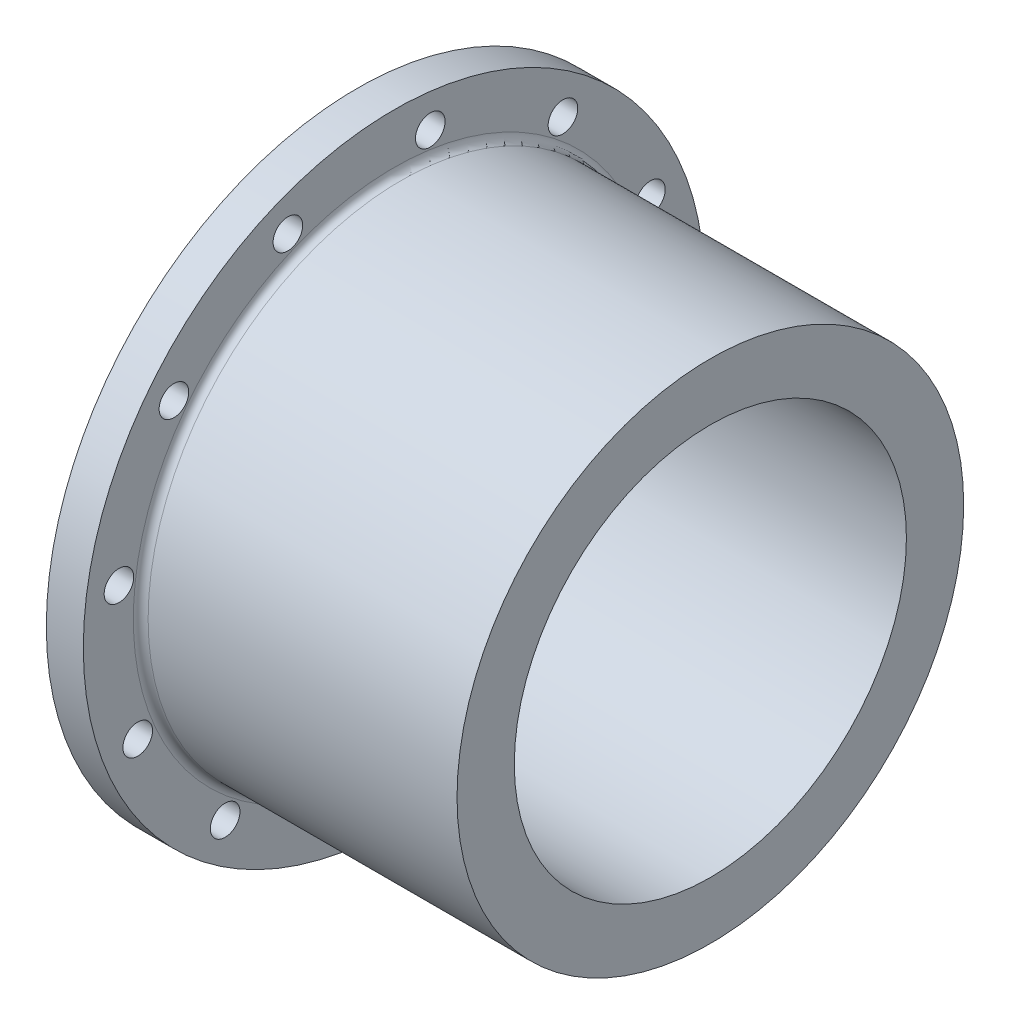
ISO-10303-21;
HEADER;
FILE_DESCRIPTION(('STEP AP214'),'2;1');
FILE_NAME('part.step','',(''),(''),'','','');
FILE_SCHEMA(('AUTOMOTIVE_DESIGN { 1 0 10303 214 1 1 1 1 }'));
ENDSEC;
DATA;
#1=APPLICATION_CONTEXT('core data for automotive mechanical design processes');
#2=APPLICATION_PROTOCOL_DEFINITION('international standard','automotive_design',2000,#1);
#3=PRODUCT_CONTEXT('',#1,'mechanical');
#4=PRODUCT('Part','Part','',(#3));
#5=PRODUCT_RELATED_PRODUCT_CATEGORY('part','',(#4));
#6=PRODUCT_DEFINITION_FORMATION('','',#4);
#7=PRODUCT_DEFINITION_CONTEXT('part definition',#1,'design');
#8=PRODUCT_DEFINITION('design','',#6,#7);
#9=PRODUCT_DEFINITION_SHAPE('','',#8);
#10=(LENGTH_UNIT() NAMED_UNIT(*) SI_UNIT(.MILLI.,.METRE.));
#11=(NAMED_UNIT(*) PLANE_ANGLE_UNIT() SI_UNIT($,.RADIAN.));
#12=(NAMED_UNIT(*) SI_UNIT($,.STERADIAN.) SOLID_ANGLE_UNIT());
#13=UNCERTAINTY_MEASURE_WITH_UNIT(LENGTH_MEASURE(1.E-05),#10,'distance_accuracy_value','');
#14=(GEOMETRIC_REPRESENTATION_CONTEXT(3) GLOBAL_UNCERTAINTY_ASSIGNED_CONTEXT((#13)) GLOBAL_UNIT_ASSIGNED_CONTEXT((#10,
#11,#12)) REPRESENTATION_CONTEXT('',''));
#15=CARTESIAN_POINT('',(0.,0.,0.));
#16=DIRECTION('',(0.,0.,1.));
#17=DIRECTION('',(1.,0.,0.));
#18=AXIS2_PLACEMENT_3D('',#15,#16,#17);
#19=CARTESIAN_POINT('',(0.,0.,0.));
#20=DIRECTION('',(-1.,0.,0.));
#21=DIRECTION('',(0.,0.,1.));
#22=AXIS2_PLACEMENT_3D('',#19,#20,#21);
#23=CYLINDRICAL_SURFACE('',#22,168.275);
#24=CARTESIAN_POINT('',(0.,0.,0.));
#25=DIRECTION('',(-1.,0.,0.));
#26=DIRECTION('',(0.,0.,1.));
#27=AXIS2_PLACEMENT_3D('',#24,#25,#26);
#28=CIRCLE('',#27,168.275);
#29=CARTESIAN_POINT('',(0.,0.,168.275));
#30=VERTEX_POINT('',#29);
#31=EDGE_CURVE('E62',#30,#30,#28,.T.);
#32=ORIENTED_EDGE('',*,*,#31,.T.);
#33=EDGE_LOOP('',(#32));
#34=FACE_BOUND('',#33,.T.);
#35=CARTESIAN_POINT('',(304.8,0.,0.));
#36=DIRECTION('',(-1.,0.,0.));
#37=DIRECTION('',(0.,0.,1.));
#38=AXIS2_PLACEMENT_3D('',#35,#36,#37);
#39=CIRCLE('',#38,168.275);
#40=CARTESIAN_POINT('',(304.8,0.,168.275));
#41=VERTEX_POINT('',#40);
#42=EDGE_CURVE('E41',#41,#41,#39,.T.);
#43=ORIENTED_EDGE('',*,*,#42,.F.);
#44=EDGE_LOOP('',(#43));
#45=FACE_BOUND('',#44,.T.);
#46=ADVANCED_FACE('F30',(#34,#45),#23,.F.);
#47=CARTESIAN_POINT('',(304.8,217.424,0.));
#48=DIRECTION('',(1.,0.,0.));
#49=DIRECTION('',(0.,0.,-1.));
#50=AXIS2_PLACEMENT_3D('',#47,#48,#49);
#51=PLANE('',#50);
#52=ORIENTED_EDGE('',*,*,#42,.T.);
#53=EDGE_LOOP('',(#52));
#54=FACE_BOUND('',#53,.T.);
#55=CARTESIAN_POINT('',(304.8,0.,0.));
#56=DIRECTION('',(-1.,0.,0.));
#57=DIRECTION('',(0.,0.,1.));
#58=AXIS2_PLACEMENT_3D('',#55,#56,#57);
#59=CIRCLE('',#58,217.424);
#60=CARTESIAN_POINT('',(304.8,0.,217.424));
#61=VERTEX_POINT('',#60);
#62=EDGE_CURVE('E45',#61,#61,#59,.T.);
#63=ORIENTED_EDGE('',*,*,#62,.F.);
#64=EDGE_LOOP('',(#63));
#65=FACE_BOUND('',#64,.T.);
#66=ADVANCED_FACE('F194',(#54,#65),#51,.T.);
#67=CARTESIAN_POINT('',(0.,0.,0.));
#68=DIRECTION('',(-1.,0.,0.));
#69=DIRECTION('',(0.,0.,1.));
#70=AXIS2_PLACEMENT_3D('',#67,#68,#69);
#71=CYLINDRICAL_SURFACE('',#70,217.424);
#72=CARTESIAN_POINT('',(39.6875,0.,0.));
#73=DIRECTION('',(1.,0.,0.));
#74=DIRECTION('',(0.,0.,-1.));
#75=AXIS2_PLACEMENT_3D('',#72,#73,#74);
#76=CIRCLE('',#75,217.424);
#77=CARTESIAN_POINT('',(39.6875,0.,-217.424));
#78=VERTEX_POINT('',#77);
#79=EDGE_CURVE('E10',#78,#78,#76,.T.);
#80=ORIENTED_EDGE('',*,*,#79,.T.);
#81=EDGE_LOOP('',(#80));
#82=FACE_BOUND('',#81,.T.);
#83=ORIENTED_EDGE('',*,*,#62,.T.);
#84=EDGE_LOOP('',(#83));
#85=FACE_BOUND('',#84,.T.);
#86=ADVANCED_FACE('F199',(#82,#85),#71,.T.);
#87=CARTESIAN_POINT('',(33.3375,266.7,0.));
#88=DIRECTION('',(1.,0.,0.));
#89=DIRECTION('',(0.,0.,-1.));
#90=AXIS2_PLACEMENT_3D('',#87,#88,#89);
#91=PLANE('',#90);
#92=CARTESIAN_POINT('',(33.3375,0.,0.));
#93=DIRECTION('',(1.,0.,0.));
#94=DIRECTION('',(0.,0.,-1.));
#95=AXIS2_PLACEMENT_3D('',#92,#93,#94);
#96=CIRCLE('',#95,223.774);
#97=CARTESIAN_POINT('',(33.3375,0.,-223.774));
#98=VERTEX_POINT('',#97);
#99=EDGE_CURVE('E37',#98,#98,#96,.F.);
#100=ORIENTED_EDGE('',*,*,#99,.T.);
#101=EDGE_LOOP('',(#100));
#102=FACE_BOUND('',#101,.T.);
#103=CARTESIAN_POINT('',(33.3375,144.961315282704,188.917264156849));
#104=DIRECTION('',(1.,0.,0.));
#105=DIRECTION('',(0.,0.499999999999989,-0.866025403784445));
#106=AXIS2_PLACEMENT_3D('',#103,#104,#105);
#107=CIRCLE('',#106,12.7);
#108=CARTESIAN_POINT('',(33.3375,151.311315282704,177.918741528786));
#109=VERTEX_POINT('',#108);
#110=EDGE_CURVE('E134',#109,#109,#107,.F.);
#111=ORIENTED_EDGE('',*,*,#110,.T.);
#112=EDGE_LOOP('',(#111));
#113=FACE_BOUND('',#112,.T.);
#114=CARTESIAN_POINT('',(33.3375,31.0815495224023,236.087807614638));
#115=DIRECTION('',(1.,0.,0.));
#116=DIRECTION('',(0.,0.866025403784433,-0.50000000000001));
#117=AXIS2_PLACEMENT_3D('',#114,#115,#116);
#118=CIRCLE('',#117,12.7);
#119=CARTESIAN_POINT('',(33.3375,42.0800721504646,229.737807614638));
#120=VERTEX_POINT('',#119);
#121=EDGE_CURVE('E128',#120,#120,#118,.F.);
#122=ORIENTED_EDGE('',*,*,#121,.T.);
#123=EDGE_LOOP('',(#122));
#124=FACE_BOUND('',#123,.T.);
#125=CARTESIAN_POINT('',(33.3375,-91.1264923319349,219.998813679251));
#126=DIRECTION('',(1.,0.,0.));
#127=DIRECTION('',(0.,1.,0.));
#128=AXIS2_PLACEMENT_3D('',#125,#126,#127);
#129=CIRCLE('',#128,12.7);
#130=CARTESIAN_POINT('',(33.3375,-78.4264923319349,219.998813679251));
#131=VERTEX_POINT('',#130);
#132=EDGE_CURVE('E122',#131,#131,#129,.F.);
#133=ORIENTED_EDGE('',*,*,#132,.T.);
#134=EDGE_LOOP('',(#133));
#135=FACE_BOUND('',#134,.T.);
#136=CARTESIAN_POINT('',(33.3375,-188.917264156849,144.961315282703));
#137=DIRECTION('',(1.,0.,0.));
#138=DIRECTION('',(0.,0.866025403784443,0.499999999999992));
#139=AXIS2_PLACEMENT_3D('',#136,#137,#138);
#140=CIRCLE('',#139,12.7);
#141=CARTESIAN_POINT('',(33.3375,-177.918741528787,151.311315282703));
#142=VERTEX_POINT('',#141);
#143=EDGE_CURVE('E116',#142,#142,#140,.F.);
#144=ORIENTED_EDGE('',*,*,#143,.T.);
#145=EDGE_LOOP('',(#144));
#146=FACE_BOUND('',#145,.T.);
#147=CARTESIAN_POINT('',(33.3375,-236.087807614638,31.0815495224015));
#148=DIRECTION('',(1.,0.,0.));
#149=DIRECTION('',(0.,0.500000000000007,0.866025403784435));
#150=AXIS2_PLACEMENT_3D('',#147,#148,#149);
#151=CIRCLE('',#150,12.7);
#152=CARTESIAN_POINT('',(33.3375,-229.737807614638,42.0800721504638));
#153=VERTEX_POINT('',#152);
#154=EDGE_CURVE('E110',#153,#153,#151,.F.);
#155=ORIENTED_EDGE('',*,*,#154,.T.);
#156=EDGE_LOOP('',(#155));
#157=FACE_BOUND('',#156,.T.);
#158=CARTESIAN_POINT('',(33.3375,-219.998813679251,-91.1264923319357));
#159=DIRECTION('',(1.,0.,0.));
#160=DIRECTION('',(0.,0.,1.));
#161=AXIS2_PLACEMENT_3D('',#158,#159,#160);
#162=CIRCLE('',#161,12.7);
#163=CARTESIAN_POINT('',(33.3375,-219.998813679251,-78.4264923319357));
#164=VERTEX_POINT('',#163);
#165=EDGE_CURVE('E104',#164,#164,#162,.F.);
#166=ORIENTED_EDGE('',*,*,#165,.T.);
#167=EDGE_LOOP('',(#166));
#168=FACE_BOUND('',#167,.T.);
#169=CARTESIAN_POINT('',(33.3375,-144.961315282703,-188.91726415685));
#170=DIRECTION('',(1.,0.,0.));
#171=DIRECTION('',(0.,-0.499999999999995,0.866025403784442));
#172=AXIS2_PLACEMENT_3D('',#169,#170,#171);
#173=CIRCLE('',#172,12.7);
#174=CARTESIAN_POINT('',(33.3375,-151.311315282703,-177.918741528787));
#175=VERTEX_POINT('',#174);
#176=EDGE_CURVE('E98',#175,#175,#173,.F.);
#177=ORIENTED_EDGE('',*,*,#176,.T.);
#178=EDGE_LOOP('',(#177));
#179=FACE_BOUND('',#178,.T.);
#180=CARTESIAN_POINT('',(33.3375,-31.0815495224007,-236.087807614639));
#181=DIRECTION('',(1.,0.,0.));
#182=DIRECTION('',(0.,-0.866025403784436,0.500000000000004));
#183=AXIS2_PLACEMENT_3D('',#180,#181,#182);
#184=CIRCLE('',#183,12.7);
#185=CARTESIAN_POINT('',(33.3375,-42.080072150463,-229.737807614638));
#186=VERTEX_POINT('',#185);
#187=EDGE_CURVE('E92',#186,#186,#184,.F.);
#188=ORIENTED_EDGE('',*,*,#187,.T.);
#189=EDGE_LOOP('',(#188));
#190=FACE_BOUND('',#189,.T.);
#191=CARTESIAN_POINT('',(33.3375,91.1264923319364,-219.99881367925));
#192=DIRECTION('',(1.,0.,0.));
#193=DIRECTION('',(0.,-1.,0.));
#194=AXIS2_PLACEMENT_3D('',#191,#192,#193);
#195=CIRCLE('',#194,12.7);
#196=CARTESIAN_POINT('',(33.3375,78.4264923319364,-219.99881367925));
#197=VERTEX_POINT('',#196);
#198=EDGE_CURVE('E86',#197,#197,#195,.F.);
#199=ORIENTED_EDGE('',*,*,#198,.T.);
#200=EDGE_LOOP('',(#199));
#201=FACE_BOUND('',#200,.T.);
#202=CARTESIAN_POINT('',(33.3375,188.91726415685,-144.961315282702));
#203=DIRECTION('',(1.,0.,0.));
#204=DIRECTION('',(0.,-0.86602540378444,-0.499999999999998));
#205=AXIS2_PLACEMENT_3D('',#202,#203,#204);
#206=CIRCLE('',#205,12.7);
#207=CARTESIAN_POINT('',(33.3375,177.918741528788,-151.311315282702));
#208=VERTEX_POINT('',#207);
#209=EDGE_CURVE('E80',#208,#208,#206,.F.);
#210=ORIENTED_EDGE('',*,*,#209,.T.);
#211=EDGE_LOOP('',(#210));
#212=FACE_BOUND('',#211,.T.);
#213=CARTESIAN_POINT('',(33.3375,236.087807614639,-31.0815495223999));
#214=DIRECTION('',(1.,0.,0.));
#215=DIRECTION('',(0.,-0.500000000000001,-0.866025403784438));
#216=AXIS2_PLACEMENT_3D('',#213,#214,#215);
#217=CIRCLE('',#216,12.7);
#218=CARTESIAN_POINT('',(33.3375,229.737807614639,-42.0800721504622));
#219=VERTEX_POINT('',#218);
#220=EDGE_CURVE('E74',#219,#219,#217,.F.);
#221=ORIENTED_EDGE('',*,*,#220,.T.);
#222=EDGE_LOOP('',(#221));
#223=FACE_BOUND('',#222,.T.);
#224=CARTESIAN_POINT('',(33.3375,219.99881367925,91.1264923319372));
#225=DIRECTION('',(1.,0.,0.));
#226=DIRECTION('',(0.,0.,-1.));
#227=AXIS2_PLACEMENT_3D('',#224,#225,#226);
#228=CIRCLE('',#227,12.7);
#229=CARTESIAN_POINT('',(33.3375,219.99881367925,78.4264923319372));
#230=VERTEX_POINT('',#229);
#231=EDGE_CURVE('E66',#230,#230,#228,.F.);
#232=ORIENTED_EDGE('',*,*,#231,.T.);
#233=EDGE_LOOP('',(#232));
#234=FACE_BOUND('',#233,.T.);
#235=CARTESIAN_POINT('',(33.3375,0.,0.));
#236=DIRECTION('',(-1.,0.,0.));
#237=DIRECTION('',(0.,0.,1.));
#238=AXIS2_PLACEMENT_3D('',#235,#236,#237);
#239=CIRCLE('',#238,266.7);
#240=CARTESIAN_POINT('',(33.3375,0.,266.7));
#241=VERTEX_POINT('',#240);
#242=EDGE_CURVE('E50',#241,#241,#239,.T.);
#243=ORIENTED_EDGE('',*,*,#242,.F.);
#244=EDGE_LOOP('',(#243));
#245=FACE_BOUND('',#244,.T.);
#246=ADVANCED_FACE('F138',(#102,#113,#124,#135,#146,#157,#168,#179,#190,#201,#212,#223,#234,
#245),#91,.T.);
#247=CARTESIAN_POINT('',(0.,0.,0.));
#248=DIRECTION('',(-1.,0.,0.));
#249=DIRECTION('',(0.,0.,1.));
#250=AXIS2_PLACEMENT_3D('',#247,#248,#249);
#251=CYLINDRICAL_SURFACE('',#250,266.7);
#252=ORIENTED_EDGE('',*,*,#242,.T.);
#253=EDGE_LOOP('',(#252));
#254=FACE_BOUND('',#253,.T.);
#255=CARTESIAN_POINT('',(1.5875,0.,0.));
#256=DIRECTION('',(-1.,0.,0.));
#257=DIRECTION('',(0.,0.,1.));
#258=AXIS2_PLACEMENT_3D('',#255,#256,#257);
#259=CIRCLE('',#258,266.7);
#260=CARTESIAN_POINT('',(1.5875,0.,266.7));
#261=VERTEX_POINT('',#260);
#262=EDGE_CURVE('E53',#261,#261,#259,.T.);
#263=ORIENTED_EDGE('',*,*,#262,.F.);
#264=EDGE_LOOP('',(#263));
#265=FACE_BOUND('',#264,.T.);
#266=ADVANCED_FACE('F152',(#254,#265),#251,.T.);
#267=CARTESIAN_POINT('',(1.5875,206.375,0.));
#268=DIRECTION('',(-1.,0.,0.));
#269=DIRECTION('',(0.,0.,1.));
#270=AXIS2_PLACEMENT_3D('',#267,#268,#269);
#271=PLANE('',#270);
#272=CARTESIAN_POINT('',(1.5875,144.961315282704,188.917264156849));
#273=DIRECTION('',(-1.,0.,0.));
#274=DIRECTION('',(0.,-0.499999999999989,0.866025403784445));
#275=AXIS2_PLACEMENT_3D('',#272,#273,#274);
#276=CIRCLE('',#275,12.7);
#277=CARTESIAN_POINT('',(1.5875,138.611315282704,199.915786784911));
#278=VERTEX_POINT('',#277);
#279=EDGE_CURVE('E131',#278,#278,#276,.T.);
#280=ORIENTED_EDGE('',*,*,#279,.F.);
#281=EDGE_LOOP('',(#280));
#282=FACE_BOUND('',#281,.T.);
#283=CARTESIAN_POINT('',(1.5875,31.0815495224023,236.087807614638));
#284=DIRECTION('',(-1.,0.,0.));
#285=DIRECTION('',(0.,-0.866025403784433,0.50000000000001));
#286=AXIS2_PLACEMENT_3D('',#283,#284,#285);
#287=CIRCLE('',#286,12.7);
#288=CARTESIAN_POINT('',(1.5875,20.08302689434,242.437807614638));
#289=VERTEX_POINT('',#288);
#290=EDGE_CURVE('E125',#289,#289,#287,.T.);
#291=ORIENTED_EDGE('',*,*,#290,.F.);
#292=EDGE_LOOP('',(#291));
#293=FACE_BOUND('',#292,.T.);
#294=CARTESIAN_POINT('',(1.5875,-91.1264923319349,219.998813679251));
#295=DIRECTION('',(-1.,0.,0.));
#296=DIRECTION('',(0.,-1.,0.));
#297=AXIS2_PLACEMENT_3D('',#294,#295,#296);
#298=CIRCLE('',#297,12.7);
#299=CARTESIAN_POINT('',(1.5875,-103.826492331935,219.998813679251));
#300=VERTEX_POINT('',#299);
#301=EDGE_CURVE('E119',#300,#300,#298,.T.);
#302=ORIENTED_EDGE('',*,*,#301,.F.);
#303=EDGE_LOOP('',(#302));
#304=FACE_BOUND('',#303,.T.);
#305=CARTESIAN_POINT('',(1.5875,-188.917264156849,144.961315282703));
#306=DIRECTION('',(-1.,0.,0.));
#307=DIRECTION('',(0.,-0.866025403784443,-0.499999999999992));
#308=AXIS2_PLACEMENT_3D('',#305,#306,#307);
#309=CIRCLE('',#308,12.7);
#310=CARTESIAN_POINT('',(1.5875,-199.915786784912,138.611315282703));
#311=VERTEX_POINT('',#310);
#312=EDGE_CURVE('E113',#311,#311,#309,.T.);
#313=ORIENTED_EDGE('',*,*,#312,.F.);
#314=EDGE_LOOP('',(#313));
#315=FACE_BOUND('',#314,.T.);
#316=CARTESIAN_POINT('',(1.5875,-236.087807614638,31.0815495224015));
#317=DIRECTION('',(-1.,0.,0.));
#318=DIRECTION('',(0.,-0.500000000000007,-0.866025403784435));
#319=AXIS2_PLACEMENT_3D('',#316,#317,#318);
#320=CIRCLE('',#319,12.7);
#321=CARTESIAN_POINT('',(1.5875,-242.437807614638,20.0830268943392));
#322=VERTEX_POINT('',#321);
#323=EDGE_CURVE('E107',#322,#322,#320,.T.);
#324=ORIENTED_EDGE('',*,*,#323,.F.);
#325=EDGE_LOOP('',(#324));
#326=FACE_BOUND('',#325,.T.);
#327=CARTESIAN_POINT('',(1.5875,-219.998813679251,-91.1264923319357));
#328=DIRECTION('',(-1.,0.,0.));
#329=DIRECTION('',(0.,0.,-1.));
#330=AXIS2_PLACEMENT_3D('',#327,#328,#329);
#331=CIRCLE('',#330,12.7);
#332=CARTESIAN_POINT('',(1.5875,-219.998813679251,-103.826492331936));
#333=VERTEX_POINT('',#332);
#334=EDGE_CURVE('E101',#333,#333,#331,.T.);
#335=ORIENTED_EDGE('',*,*,#334,.F.);
#336=EDGE_LOOP('',(#335));
#337=FACE_BOUND('',#336,.T.);
#338=CARTESIAN_POINT('',(1.5875,-144.961315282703,-188.91726415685));
#339=DIRECTION('',(-1.,0.,0.));
#340=DIRECTION('',(0.,0.499999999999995,-0.866025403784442));
#341=AXIS2_PLACEMENT_3D('',#338,#339,#340);
#342=CIRCLE('',#341,12.7);
#343=CARTESIAN_POINT('',(1.5875,-138.611315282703,-199.915786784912));
#344=VERTEX_POINT('',#343);
#345=EDGE_CURVE('E95',#344,#344,#342,.T.);
#346=ORIENTED_EDGE('',*,*,#345,.F.);
#347=EDGE_LOOP('',(#346));
#348=FACE_BOUND('',#347,.T.);
#349=CARTESIAN_POINT('',(1.5875,-31.0815495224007,-236.087807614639));
#350=DIRECTION('',(-1.,0.,0.));
#351=DIRECTION('',(0.,0.866025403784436,-0.500000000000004));
#352=AXIS2_PLACEMENT_3D('',#349,#350,#351);
#353=CIRCLE('',#352,12.7);
#354=CARTESIAN_POINT('',(1.5875,-20.0830268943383,-242.437807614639));
#355=VERTEX_POINT('',#354);
#356=EDGE_CURVE('E89',#355,#355,#353,.T.);
#357=ORIENTED_EDGE('',*,*,#356,.F.);
#358=EDGE_LOOP('',(#357));
#359=FACE_BOUND('',#358,.T.);
#360=CARTESIAN_POINT('',(1.5875,91.1264923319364,-219.99881367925));
#361=DIRECTION('',(-1.,0.,0.));
#362=DIRECTION('',(0.,1.,0.));
#363=AXIS2_PLACEMENT_3D('',#360,#361,#362);
#364=CIRCLE('',#363,12.7);
#365=CARTESIAN_POINT('',(1.5875,103.826492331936,-219.99881367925));
#366=VERTEX_POINT('',#365);
#367=EDGE_CURVE('E83',#366,#366,#364,.T.);
#368=ORIENTED_EDGE('',*,*,#367,.F.);
#369=EDGE_LOOP('',(#368));
#370=FACE_BOUND('',#369,.T.);
#371=CARTESIAN_POINT('',(1.5875,188.91726415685,-144.961315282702));
#372=DIRECTION('',(-1.,0.,0.));
#373=DIRECTION('',(0.,0.86602540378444,0.499999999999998));
#374=AXIS2_PLACEMENT_3D('',#371,#372,#373);
#375=CIRCLE('',#374,12.7);
#376=CARTESIAN_POINT('',(1.5875,199.915786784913,-138.611315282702));
#377=VERTEX_POINT('',#376);
#378=EDGE_CURVE('E77',#377,#377,#375,.T.);
#379=ORIENTED_EDGE('',*,*,#378,.F.);
#380=EDGE_LOOP('',(#379));
#381=FACE_BOUND('',#380,.T.);
#382=CARTESIAN_POINT('',(1.5875,236.087807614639,-31.0815495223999));
#383=DIRECTION('',(-1.,0.,0.));
#384=DIRECTION('',(0.,0.500000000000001,0.866025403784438));
#385=AXIS2_PLACEMENT_3D('',#382,#383,#384);
#386=CIRCLE('',#385,12.7);
#387=CARTESIAN_POINT('',(1.5875,242.437807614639,-20.0830268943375));
#388=VERTEX_POINT('',#387);
#389=EDGE_CURVE('E69',#388,#388,#386,.T.);
#390=ORIENTED_EDGE('',*,*,#389,.F.);
#391=EDGE_LOOP('',(#390));
#392=FACE_BOUND('',#391,.T.);
#393=CARTESIAN_POINT('',(1.5875,219.99881367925,91.1264923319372));
#394=DIRECTION('',(-1.,0.,0.));
#395=DIRECTION('',(0.,0.,1.));
#396=AXIS2_PLACEMENT_3D('',#393,#394,#395);
#397=CIRCLE('',#396,12.7);
#398=CARTESIAN_POINT('',(1.5875,219.99881367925,103.826492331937));
#399=VERTEX_POINT('',#398);
#400=EDGE_CURVE('E65',#399,#399,#397,.T.);
#401=ORIENTED_EDGE('',*,*,#400,.F.);
#402=EDGE_LOOP('',(#401));
#403=FACE_BOUND('',#402,.T.);
#404=ORIENTED_EDGE('',*,*,#262,.T.);
#405=EDGE_LOOP('',(#404));
#406=FACE_BOUND('',#405,.T.);
#407=CARTESIAN_POINT('',(1.5875,0.,0.));
#408=DIRECTION('',(-1.,0.,0.));
#409=DIRECTION('',(0.,0.,1.));
#410=AXIS2_PLACEMENT_3D('',#407,#408,#409);
#411=CIRCLE('',#410,206.375);
#412=CARTESIAN_POINT('',(1.5875,0.,206.375));
#413=VERTEX_POINT('',#412);
#414=EDGE_CURVE('E56',#413,#413,#411,.T.);
#415=ORIENTED_EDGE('',*,*,#414,.F.);
#416=EDGE_LOOP('',(#415));
#417=FACE_BOUND('',#416,.T.);
#418=ADVANCED_FACE('F148',(#282,#293,#304,#315,#326,#337,#348,#359,#370,#381,#392,#403,#406,
#417),#271,.T.);
#419=CARTESIAN_POINT('',(0.,0.,0.));
#420=DIRECTION('',(-1.,0.,0.));
#421=DIRECTION('',(0.,0.,1.));
#422=AXIS2_PLACEMENT_3D('',#419,#420,#421);
#423=CYLINDRICAL_SURFACE('',#422,206.375);
#424=ORIENTED_EDGE('',*,*,#414,.T.);
#425=EDGE_LOOP('',(#424));
#426=FACE_BOUND('',#425,.T.);
#427=CARTESIAN_POINT('',(0.,0.,0.));
#428=DIRECTION('',(-1.,0.,0.));
#429=DIRECTION('',(0.,0.,1.));
#430=AXIS2_PLACEMENT_3D('',#427,#428,#429);
#431=CIRCLE('',#430,206.375);
#432=CARTESIAN_POINT('',(0.,0.,206.375));
#433=VERTEX_POINT('',#432);
#434=EDGE_CURVE('E59',#433,#433,#431,.T.);
#435=ORIENTED_EDGE('',*,*,#434,.F.);
#436=EDGE_LOOP('',(#435));
#437=FACE_BOUND('',#436,.T.);
#438=ADVANCED_FACE('F151',(#426,#437),#423,.T.);
#439=CARTESIAN_POINT('',(0.,168.275,0.));
#440=DIRECTION('',(-1.,0.,0.));
#441=DIRECTION('',(0.,0.,1.));
#442=AXIS2_PLACEMENT_3D('',#439,#440,#441);
#443=PLANE('',#442);
#444=ORIENTED_EDGE('',*,*,#434,.T.);
#445=EDGE_LOOP('',(#444));
#446=FACE_BOUND('',#445,.T.);
#447=ORIENTED_EDGE('',*,*,#31,.F.);
#448=EDGE_LOOP('',(#447));
#449=FACE_BOUND('',#448,.T.);
#450=ADVANCED_FACE('F182',(#446,#449),#443,.T.);
#451=CARTESIAN_POINT('',(304.801,219.99881367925,91.1264923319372));
#452=DIRECTION('',(-1.,0.,0.));
#453=DIRECTION('',(0.,0.,1.));
#454=AXIS2_PLACEMENT_3D('',#451,#452,#453);
#455=CYLINDRICAL_SURFACE('',#454,12.7);
#456=ORIENTED_EDGE('',*,*,#231,.F.);
#457=EDGE_LOOP('',(#456));
#458=FACE_BOUND('',#457,.T.);
#459=ORIENTED_EDGE('',*,*,#400,.T.);
#460=EDGE_LOOP('',(#459));
#461=FACE_BOUND('',#460,.T.);
#462=ADVANCED_FACE('F188',(#458,#461),#455,.F.);
#463=CARTESIAN_POINT('',(304.801,236.087807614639,-31.0815495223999));
#464=DIRECTION('',(-1.,0.,0.));
#465=DIRECTION('',(0.,0.500000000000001,0.866025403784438));
#466=AXIS2_PLACEMENT_3D('',#463,#464,#465);
#467=CYLINDRICAL_SURFACE('',#466,12.7);
#468=ORIENTED_EDGE('',*,*,#220,.F.);
#469=EDGE_LOOP('',(#468));
#470=FACE_BOUND('',#469,.T.);
#471=ORIENTED_EDGE('',*,*,#389,.T.);
#472=EDGE_LOOP('',(#471));
#473=FACE_BOUND('',#472,.T.);
#474=ADVANCED_FACE('F215',(#470,#473),#467,.F.);
#475=CARTESIAN_POINT('',(304.801,188.91726415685,-144.961315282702));
#476=DIRECTION('',(-1.,0.,0.));
#477=DIRECTION('',(0.,0.86602540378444,0.499999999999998));
#478=AXIS2_PLACEMENT_3D('',#475,#476,#477);
#479=CYLINDRICAL_SURFACE('',#478,12.7);
#480=ORIENTED_EDGE('',*,*,#209,.F.);
#481=EDGE_LOOP('',(#480));
#482=FACE_BOUND('',#481,.T.);
#483=ORIENTED_EDGE('',*,*,#378,.T.);
#484=EDGE_LOOP('',(#483));
#485=FACE_BOUND('',#484,.T.);
#486=ADVANCED_FACE('F219',(#482,#485),#479,.F.);
#487=CARTESIAN_POINT('',(304.801,91.1264923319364,-219.99881367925));
#488=DIRECTION('',(-1.,0.,0.));
#489=DIRECTION('',(0.,1.,0.));
#490=AXIS2_PLACEMENT_3D('',#487,#488,#489);
#491=CYLINDRICAL_SURFACE('',#490,12.7);
#492=ORIENTED_EDGE('',*,*,#198,.F.);
#493=EDGE_LOOP('',(#492));
#494=FACE_BOUND('',#493,.T.);
#495=ORIENTED_EDGE('',*,*,#367,.T.);
#496=EDGE_LOOP('',(#495));
#497=FACE_BOUND('',#496,.T.);
#498=ADVANCED_FACE('F223',(#494,#497),#491,.F.);
#499=CARTESIAN_POINT('',(304.801,-31.0815495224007,-236.087807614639));
#500=DIRECTION('',(-1.,0.,0.));
#501=DIRECTION('',(0.,0.866025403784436,-0.500000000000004));
#502=AXIS2_PLACEMENT_3D('',#499,#500,#501);
#503=CYLINDRICAL_SURFACE('',#502,12.7);
#504=ORIENTED_EDGE('',*,*,#187,.F.);
#505=EDGE_LOOP('',(#504));
#506=FACE_BOUND('',#505,.T.);
#507=ORIENTED_EDGE('',*,*,#356,.T.);
#508=EDGE_LOOP('',(#507));
#509=FACE_BOUND('',#508,.T.);
#510=ADVANCED_FACE('F227',(#506,#509),#503,.F.);
#511=CARTESIAN_POINT('',(304.801,-144.961315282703,-188.91726415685));
#512=DIRECTION('',(-1.,0.,0.));
#513=DIRECTION('',(0.,0.499999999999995,-0.866025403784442));
#514=AXIS2_PLACEMENT_3D('',#511,#512,#513);
#515=CYLINDRICAL_SURFACE('',#514,12.7);
#516=ORIENTED_EDGE('',*,*,#176,.F.);
#517=EDGE_LOOP('',(#516));
#518=FACE_BOUND('',#517,.T.);
#519=ORIENTED_EDGE('',*,*,#345,.T.);
#520=EDGE_LOOP('',(#519));
#521=FACE_BOUND('',#520,.T.);
#522=ADVANCED_FACE('F231',(#518,#521),#515,.F.);
#523=CARTESIAN_POINT('',(304.801,-219.998813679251,-91.1264923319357));
#524=DIRECTION('',(-1.,0.,0.));
#525=DIRECTION('',(0.,0.,-1.));
#526=AXIS2_PLACEMENT_3D('',#523,#524,#525);
#527=CYLINDRICAL_SURFACE('',#526,12.7);
#528=ORIENTED_EDGE('',*,*,#165,.F.);
#529=EDGE_LOOP('',(#528));
#530=FACE_BOUND('',#529,.T.);
#531=ORIENTED_EDGE('',*,*,#334,.T.);
#532=EDGE_LOOP('',(#531));
#533=FACE_BOUND('',#532,.T.);
#534=ADVANCED_FACE('F235',(#530,#533),#527,.F.);
#535=CARTESIAN_POINT('',(304.801,-236.087807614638,31.0815495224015));
#536=DIRECTION('',(-1.,0.,0.));
#537=DIRECTION('',(0.,-0.500000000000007,-0.866025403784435));
#538=AXIS2_PLACEMENT_3D('',#535,#536,#537);
#539=CYLINDRICAL_SURFACE('',#538,12.7);
#540=ORIENTED_EDGE('',*,*,#154,.F.);
#541=EDGE_LOOP('',(#540));
#542=FACE_BOUND('',#541,.T.);
#543=ORIENTED_EDGE('',*,*,#323,.T.);
#544=EDGE_LOOP('',(#543));
#545=FACE_BOUND('',#544,.T.);
#546=ADVANCED_FACE('F239',(#542,#545),#539,.F.);
#547=CARTESIAN_POINT('',(304.801,-188.917264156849,144.961315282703));
#548=DIRECTION('',(-1.,0.,0.));
#549=DIRECTION('',(0.,-0.866025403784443,-0.499999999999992));
#550=AXIS2_PLACEMENT_3D('',#547,#548,#549);
#551=CYLINDRICAL_SURFACE('',#550,12.7);
#552=ORIENTED_EDGE('',*,*,#143,.F.);
#553=EDGE_LOOP('',(#552));
#554=FACE_BOUND('',#553,.T.);
#555=ORIENTED_EDGE('',*,*,#312,.T.);
#556=EDGE_LOOP('',(#555));
#557=FACE_BOUND('',#556,.T.);
#558=ADVANCED_FACE('F243',(#554,#557),#551,.F.);
#559=CARTESIAN_POINT('',(304.801,-91.1264923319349,219.998813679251));
#560=DIRECTION('',(-1.,0.,0.));
#561=DIRECTION('',(0.,-1.,0.));
#562=AXIS2_PLACEMENT_3D('',#559,#560,#561);
#563=CYLINDRICAL_SURFACE('',#562,12.7);
#564=ORIENTED_EDGE('',*,*,#132,.F.);
#565=EDGE_LOOP('',(#564));
#566=FACE_BOUND('',#565,.T.);
#567=ORIENTED_EDGE('',*,*,#301,.T.);
#568=EDGE_LOOP('',(#567));
#569=FACE_BOUND('',#568,.T.);
#570=ADVANCED_FACE('F247',(#566,#569),#563,.F.);
#571=CARTESIAN_POINT('',(304.801,31.0815495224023,236.087807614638));
#572=DIRECTION('',(-1.,0.,0.));
#573=DIRECTION('',(0.,-0.866025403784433,0.50000000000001));
#574=AXIS2_PLACEMENT_3D('',#571,#572,#573);
#575=CYLINDRICAL_SURFACE('',#574,12.7);
#576=ORIENTED_EDGE('',*,*,#121,.F.);
#577=EDGE_LOOP('',(#576));
#578=FACE_BOUND('',#577,.T.);
#579=ORIENTED_EDGE('',*,*,#290,.T.);
#580=EDGE_LOOP('',(#579));
#581=FACE_BOUND('',#580,.T.);
#582=ADVANCED_FACE('F144',(#578,#581),#575,.F.);
#583=CARTESIAN_POINT('',(304.801,144.961315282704,188.917264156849));
#584=DIRECTION('',(-1.,0.,0.));
#585=DIRECTION('',(0.,-0.499999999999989,0.866025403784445));
#586=AXIS2_PLACEMENT_3D('',#583,#584,#585);
#587=CYLINDRICAL_SURFACE('',#586,12.7);
#588=ORIENTED_EDGE('',*,*,#110,.F.);
#589=EDGE_LOOP('',(#588));
#590=FACE_BOUND('',#589,.T.);
#591=ORIENTED_EDGE('',*,*,#279,.T.);
#592=EDGE_LOOP('',(#591));
#593=FACE_BOUND('',#592,.T.);
#594=ADVANCED_FACE('F141',(#590,#593),#587,.F.);
#595=CARTESIAN_POINT('',(39.6875,0.,0.));
#596=DIRECTION('',(1.,0.,0.));
#597=DIRECTION('',(0.,0.,-1.));
#598=AXIS2_PLACEMENT_3D('',#595,#596,#597);
#599=TOROIDAL_SURFACE('',#598,223.774,6.35);
#600=ORIENTED_EDGE('',*,*,#79,.F.);
#601=EDGE_LOOP('',(#600));
#602=FACE_BOUND('',#601,.T.);
#603=ORIENTED_EDGE('',*,*,#99,.F.);
#604=EDGE_LOOP('',(#603));
#605=FACE_BOUND('',#604,.T.);
#606=ADVANCED_FACE('F32',(#602,#605),#599,.F.);
#607=CLOSED_SHELL('',(#46,#66,#86,#246,#266,#418,#438,#450,#462,#474,#486,#498,#510,#522,#534,
#546,#558,#570,#582,#594,#606));
#608=MANIFOLD_SOLID_BREP('B2',#607);
#609=ADVANCED_BREP_SHAPE_REPRESENTATION('',(#18,#608),#14);
#610=SHAPE_DEFINITION_REPRESENTATION(#9,#609);
ENDSEC;
END-ISO-10303-21;
